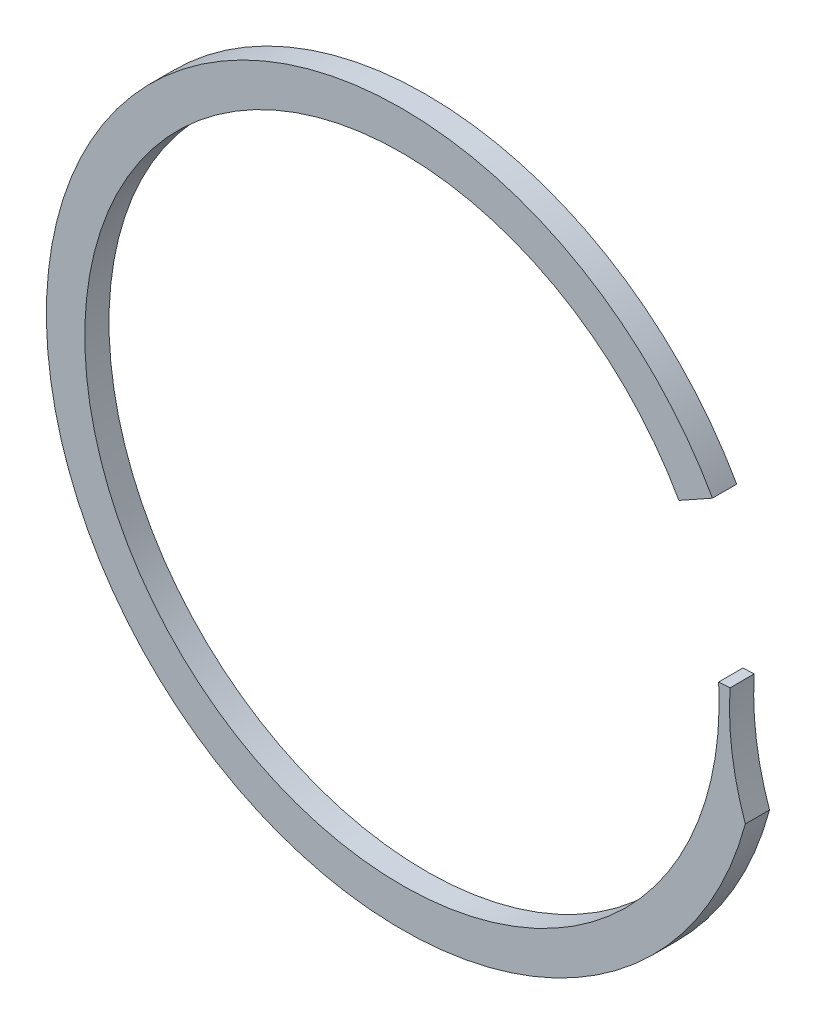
ISO-10303-21;
HEADER;
FILE_DESCRIPTION(('STEP AP214'),'2;1');
FILE_NAME('part.step','',(''),(''),'','','');
FILE_SCHEMA(('AUTOMOTIVE_DESIGN { 1 0 10303 214 1 1 1 1 }'));
ENDSEC;
DATA;
#1=APPLICATION_CONTEXT('core data for automotive mechanical design processes');
#2=APPLICATION_PROTOCOL_DEFINITION('international standard','automotive_design',2000,#1);
#3=PRODUCT_CONTEXT('',#1,'mechanical');
#4=PRODUCT('Part','Part','',(#3));
#5=PRODUCT_RELATED_PRODUCT_CATEGORY('part','',(#4));
#6=PRODUCT_DEFINITION_FORMATION('','',#4);
#7=PRODUCT_DEFINITION_CONTEXT('part definition',#1,'design');
#8=PRODUCT_DEFINITION('design','',#6,#7);
#9=PRODUCT_DEFINITION_SHAPE('','',#8);
#10=(LENGTH_UNIT() NAMED_UNIT(*) SI_UNIT(.MILLI.,.METRE.));
#11=(NAMED_UNIT(*) PLANE_ANGLE_UNIT() SI_UNIT($,.RADIAN.));
#12=(NAMED_UNIT(*) SI_UNIT($,.STERADIAN.) SOLID_ANGLE_UNIT());
#13=UNCERTAINTY_MEASURE_WITH_UNIT(LENGTH_MEASURE(1.E-05),#10,'distance_accuracy_value','');
#14=(GEOMETRIC_REPRESENTATION_CONTEXT(3) GLOBAL_UNCERTAINTY_ASSIGNED_CONTEXT((#13)) GLOBAL_UNIT_ASSIGNED_CONTEXT((#10,
#11,#12)) REPRESENTATION_CONTEXT('',''));
#15=CARTESIAN_POINT('',(0.,0.,0.));
#16=DIRECTION('',(0.,0.,1.));
#17=DIRECTION('',(1.,0.,0.));
#18=AXIS2_PLACEMENT_3D('',#15,#16,#17);
#19=CARTESIAN_POINT('',(0.,0.,0.7366));
#20=DIRECTION('',(0.,0.,-1.));
#21=DIRECTION('',(-1.,0.,0.));
#22=AXIS2_PLACEMENT_3D('',#19,#20,#21);
#23=CYLINDRICAL_SURFACE('',#22,10.8204);
#24=CARTESIAN_POINT('',(0.,0.,0.));
#25=DIRECTION('',(0.,0.,1.));
#26=DIRECTION('',(1.,0.,0.));
#27=AXIS2_PLACEMENT_3D('',#24,#25,#26);
#28=CIRCLE('',#27,10.8204);
#29=CARTESIAN_POINT('',(9.44821889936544,5.27372883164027,0.));
#30=VERTEX_POINT('',#29);
#31=CARTESIAN_POINT('',(10.4485132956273,-2.8124057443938,0.));
#32=VERTEX_POINT('',#31);
#33=EDGE_CURVE('E112',#30,#32,#28,.T.);
#34=ORIENTED_EDGE('',*,*,#33,.T.);
#35=DIRECTION('',(0.,0.,1.));
#36=VECTOR('',#35,1.);
#37=CARTESIAN_POINT('',(10.4485132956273,-2.8124057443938,0.3683));
#38=LINE('',#37,#36);
#39=CARTESIAN_POINT('',(10.4485132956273,-2.8124057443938,0.7366));
#40=VERTEX_POINT('',#39);
#41=EDGE_CURVE('E96',#32,#40,#38,.T.);
#42=ORIENTED_EDGE('',*,*,#41,.T.);
#43=CARTESIAN_POINT('',(0.,0.,0.7366));
#44=DIRECTION('',(0.,0.,1.));
#45=DIRECTION('',(1.,0.,0.));
#46=AXIS2_PLACEMENT_3D('',#43,#44,#45);
#47=CIRCLE('',#46,10.8204);
#48=CARTESIAN_POINT('',(9.44821889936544,5.27372883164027,0.7366));
#49=VERTEX_POINT('',#48);
#50=EDGE_CURVE('E92',#49,#40,#47,.T.);
#51=ORIENTED_EDGE('',*,*,#50,.F.);
#52=DIRECTION('',(0.,0.,-1.));
#53=VECTOR('',#52,1.);
#54=CARTESIAN_POINT('',(9.44821889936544,5.27372883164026,0.7366));
#55=LINE('',#54,#53);
#56=EDGE_CURVE('E105',#49,#30,#55,.T.);
#57=ORIENTED_EDGE('',*,*,#56,.T.);
#58=EDGE_LOOP('',(#34,#42,#51,#57));
#59=FACE_BOUND('',#58,.T.);
#60=ADVANCED_FACE('F35',(#59),#23,.T.);
#61=CARTESIAN_POINT('',(0.,0.,0.7366));
#62=DIRECTION('',(0.,0.,1.));
#63=DIRECTION('',(1.,0.,0.));
#64=AXIS2_PLACEMENT_3D('',#61,#62,#63);
#65=PLANE('',#64);
#66=CARTESIAN_POINT('',(18.4062169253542,0.,0.7366));
#67=DIRECTION('',(0.,0.,1.));
#68=DIRECTION('',(1.,0.,0.));
#69=AXIS2_PLACEMENT_3D('',#66,#67,#68);
#70=CIRCLE('',#69,8.44006357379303);
#71=CARTESIAN_POINT('',(9.98368996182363,0.543794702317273,0.7366));
#72=VERTEX_POINT('',#71);
#73=EDGE_CURVE('E79',#72,#40,#70,.T.);
#74=ORIENTED_EDGE('',*,*,#73,.F.);
#75=DIRECTION('',(0.998519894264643,0.0543876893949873,0.));
#76=VECTOR('',#75,1.);
#77=CARTESIAN_POINT('',(16.7485759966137,0.912266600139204,0.7366));
#78=LINE('',#77,#76);
#79=CARTESIAN_POINT('',(9.63771401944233,0.524949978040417,0.7366));
#80=VERTEX_POINT('',#79);
#81=EDGE_CURVE('E89',#80,#72,#78,.T.);
#82=ORIENTED_EDGE('',*,*,#81,.F.);
#83=CARTESIAN_POINT('',(0.,0.,0.7366));
#84=DIRECTION('',(0.,0.,1.));
#85=DIRECTION('',(1.,0.,0.));
#86=AXIS2_PLACEMENT_3D('',#83,#84,#85);
#87=CIRCLE('',#86,9.652);
#88=CARTESIAN_POINT('',(8.4279886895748,4.70426515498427,0.7366));
#89=VERTEX_POINT('',#88);
#90=EDGE_CURVE('E108',#89,#80,#87,.T.);
#91=ORIENTED_EDGE('',*,*,#90,.F.);
#92=DIRECTION('',(-0.873185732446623,-0.487387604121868,0.));
#93=VECTOR('',#92,1.);
#94=CARTESIAN_POINT('',(0.,0.,0.7366));
#95=LINE('',#94,#93);
#96=EDGE_CURVE('E56',#49,#89,#95,.T.);
#97=ORIENTED_EDGE('',*,*,#96,.F.);
#98=ORIENTED_EDGE('',*,*,#50,.T.);
#99=EDGE_LOOP('',(#74,#82,#91,#97,#98));
#100=FACE_BOUND('',#99,.T.);
#101=ADVANCED_FACE('F87',(#100),#65,.T.);
#102=CARTESIAN_POINT('',(0.,0.,0.));
#103=DIRECTION('',(0.,0.,1.));
#104=DIRECTION('',(1.,0.,0.));
#105=AXIS2_PLACEMENT_3D('',#102,#103,#104);
#106=PLANE('',#105);
#107=DIRECTION('',(0.998519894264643,0.0543876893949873,0.));
#108=VECTOR('',#107,1.);
#109=CARTESIAN_POINT('',(16.7485759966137,0.912266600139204,0.));
#110=LINE('',#109,#108);
#111=CARTESIAN_POINT('',(9.63771401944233,0.524949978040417,0.));
#112=VERTEX_POINT('',#111);
#113=CARTESIAN_POINT('',(9.98368996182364,0.543794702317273,0.));
#114=VERTEX_POINT('',#113);
#115=EDGE_CURVE('E98',#112,#114,#110,.T.);
#116=ORIENTED_EDGE('',*,*,#115,.T.);
#117=CARTESIAN_POINT('',(18.4062169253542,0.,0.));
#118=DIRECTION('',(0.,0.,1.));
#119=DIRECTION('',(1.,0.,0.));
#120=AXIS2_PLACEMENT_3D('',#117,#118,#119);
#121=CIRCLE('',#120,8.44006357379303);
#122=EDGE_CURVE('E49',#114,#32,#121,.T.);
#123=ORIENTED_EDGE('',*,*,#122,.T.);
#124=ORIENTED_EDGE('',*,*,#33,.F.);
#125=DIRECTION('',(-0.873185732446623,-0.487387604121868,0.));
#126=VECTOR('',#125,1.);
#127=CARTESIAN_POINT('',(0.,0.,0.));
#128=LINE('',#127,#126);
#129=CARTESIAN_POINT('',(8.4279886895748,4.70426515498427,0.));
#130=VERTEX_POINT('',#129);
#131=EDGE_CURVE('E102',#30,#130,#128,.T.);
#132=ORIENTED_EDGE('',*,*,#131,.T.);
#133=CARTESIAN_POINT('',(0.,0.,0.));
#134=DIRECTION('',(0.,0.,1.));
#135=DIRECTION('',(1.,0.,0.));
#136=AXIS2_PLACEMENT_3D('',#133,#134,#135);
#137=CIRCLE('',#136,9.652);
#138=EDGE_CURVE('E109',#130,#112,#137,.T.);
#139=ORIENTED_EDGE('',*,*,#138,.T.);
#140=EDGE_LOOP('',(#116,#123,#124,#132,#139));
#141=FACE_BOUND('',#140,.T.);
#142=ADVANCED_FACE('F123',(#141),#106,.F.);
#143=CARTESIAN_POINT('',(0.,0.,0.));
#144=DIRECTION('',(0.,0.,1.));
#145=DIRECTION('',(1.,0.,0.));
#146=AXIS2_PLACEMENT_3D('',#143,#144,#145);
#147=CYLINDRICAL_SURFACE('',#146,9.652);
#148=ORIENTED_EDGE('',*,*,#90,.T.);
#149=DIRECTION('',(0.,0.,1.));
#150=VECTOR('',#149,1.);
#151=CARTESIAN_POINT('',(9.63771401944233,0.524949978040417,0.));
#152=LINE('',#151,#150);
#153=EDGE_CURVE('E42',#80,#112,#152,.F.);
#154=ORIENTED_EDGE('',*,*,#153,.T.);
#155=ORIENTED_EDGE('',*,*,#138,.F.);
#156=DIRECTION('',(0.,0.,1.));
#157=VECTOR('',#156,1.);
#158=CARTESIAN_POINT('',(8.4279886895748,4.70426515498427,0.));
#159=LINE('',#158,#157);
#160=EDGE_CURVE('E115',#130,#89,#159,.T.);
#161=ORIENTED_EDGE('',*,*,#160,.T.);
#162=EDGE_LOOP('',(#148,#154,#155,#161));
#163=FACE_BOUND('',#162,.T.);
#164=ADVANCED_FACE('F120',(#163),#147,.F.);
#165=CARTESIAN_POINT('',(0.,0.,0.));
#166=DIRECTION('',(-0.487387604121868,0.873185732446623,0.));
#167=DIRECTION('',(-0.873185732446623,-0.487387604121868,0.));
#168=AXIS2_PLACEMENT_3D('',#165,#166,#167);
#169=PLANE('',#168);
#170=ORIENTED_EDGE('',*,*,#96,.T.);
#171=ORIENTED_EDGE('',*,*,#160,.F.);
#172=ORIENTED_EDGE('',*,*,#131,.F.);
#173=ORIENTED_EDGE('',*,*,#56,.F.);
#174=EDGE_LOOP('',(#170,#171,#172,#173));
#175=FACE_BOUND('',#174,.T.);
#176=ADVANCED_FACE('F127',(#175),#169,.F.);
#177=CARTESIAN_POINT('',(16.7485759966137,0.912266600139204,0.));
#178=DIRECTION('',(0.0543876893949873,-0.998519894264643,0.));
#179=DIRECTION('',(0.998519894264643,0.0543876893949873,0.));
#180=AXIS2_PLACEMENT_3D('',#177,#178,#179);
#181=PLANE('',#180);
#182=ORIENTED_EDGE('',*,*,#81,.T.);
#183=DIRECTION('',(0.,0.,1.));
#184=VECTOR('',#183,1.);
#185=CARTESIAN_POINT('',(9.98368996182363,0.543794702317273,0.));
#186=LINE('',#185,#184);
#187=EDGE_CURVE('E11',#72,#114,#186,.F.);
#188=ORIENTED_EDGE('',*,*,#187,.T.);
#189=ORIENTED_EDGE('',*,*,#115,.F.);
#190=ORIENTED_EDGE('',*,*,#153,.F.);
#191=EDGE_LOOP('',(#182,#188,#189,#190));
#192=FACE_BOUND('',#191,.T.);
#193=ADVANCED_FACE('F94',(#192),#181,.F.);
#194=CARTESIAN_POINT('',(18.4062169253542,0.,0.));
#195=DIRECTION('',(0.,0.,1.));
#196=DIRECTION('',(1.,0.,0.));
#197=AXIS2_PLACEMENT_3D('',#194,#195,#196);
#198=CYLINDRICAL_SURFACE('',#197,8.44006357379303);
#199=ORIENTED_EDGE('',*,*,#122,.F.);
#200=ORIENTED_EDGE('',*,*,#187,.F.);
#201=ORIENTED_EDGE('',*,*,#73,.T.);
#202=ORIENTED_EDGE('',*,*,#41,.F.);
#203=EDGE_LOOP('',(#199,#200,#201,#202));
#204=FACE_BOUND('',#203,.T.);
#205=ADVANCED_FACE('F78',(#204),#198,.F.);
#206=CLOSED_SHELL('',(#60,#101,#142,#164,#176,#193,#205));
#207=MANIFOLD_SOLID_BREP('B2',#206);
#208=ADVANCED_BREP_SHAPE_REPRESENTATION('',(#18,#207),#14);
#209=SHAPE_DEFINITION_REPRESENTATION(#9,#208);
ENDSEC;
END-ISO-10303-21;
